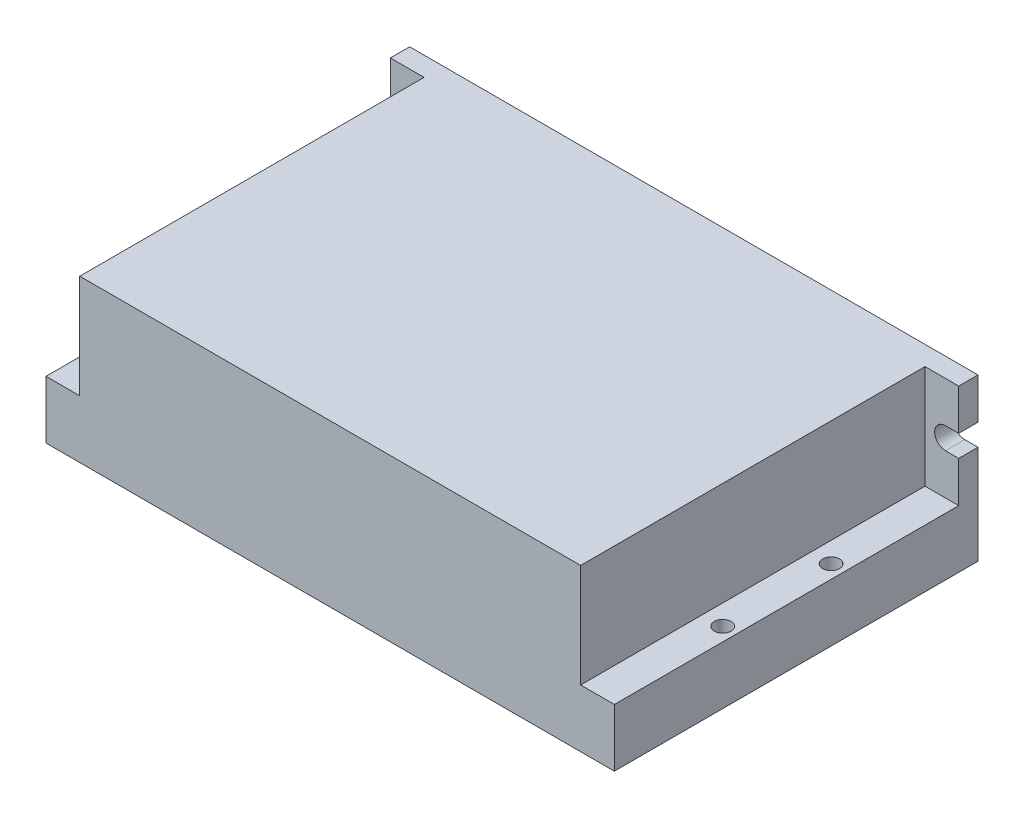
from build123d import *

# Parameters (mm, degrees)
SKETCH_1_W          = 118
SKETCH_1_H          = 75.5
EXTRUDE_1_DEPTH     = 33.5
SKETCH_2_W          = 7
SKETCH_2_H          = 21.5
CUT_EXTRUDE_1_DEPTH = 71.5
CUT_EXTRUDE_2_DEPTH = 4
SKETCH_5_R          = 1.75
CUT_EXTRUDE_3_DEPTH = 12


with BuildPart() as part:
    # Sketch 1 → Extrude 1 (new body)
    with BuildSketch(Plane(origin=(0, 0, 0), x_dir=(1, 0, 0), z_dir=(0, 1, 0))):
        with Locations((59, 37.75)):
            Rectangle(SKETCH_1_W, SKETCH_1_H)
    extrude(amount=EXTRUDE_1_DEPTH)

    # Sketch 2 → Cut-Extrude 1 (cut)
    with BuildSketch(Plane.XY):
        with Locations((3.5, 22.75)):
            Rectangle(SKETCH_2_W, SKETCH_2_H)
        with Locations((114.5, 22.75)):
            Rectangle(SKETCH_2_W, SKETCH_2_H)
    extrude(amount=-CUT_EXTRUDE_1_DEPTH, mode=Mode.SUBTRACT)

    # Sketch 3 → Cut-Extrude 2 (cut)
    with BuildSketch(Plane.XY.offset(-71.5)):
        with BuildLine():
            Line((115.25, 25), (118, 25))
            Line((118, 25), (118, 20.5))
            Line((118, 20.5), (115.25, 20.5))
            ThreePointArc((115.25, 20.5), (113, 22.75), (115.25, 25))
        make_face()
        with BuildLine():
            Line((2.75, 25), (0, 25))
            Line((0, 25), (0, 20.5))
            Line((0, 20.5), (2.75, 20.5))
            ThreePointArc((2.75, 20.5), (5, 22.75), (2.75, 25))
        make_face()
    extrude(amount=-CUT_EXTRUDE_2_DEPTH, mode=Mode.SUBTRACT)

    # Sketch 5 → Cut-Extrude 3 (cut)
    with BuildSketch(Plane(origin=(0, 12, 0), x_dir=(1, 0, 0), z_dir=(0, 1, 0))):
        with Locations(Location((115.2, 47.8, 0), (0, 0, 270))):
            Circle(SKETCH_5_R)
        with Locations(Location((115.2, 25.3, 0), (0, 0, 270))):
            Circle(SKETCH_5_R)
        with Locations(Location((2.8, 25.3, 0), (0, 0, 270))):
            Circle(SKETCH_5_R)
        with Locations(Location((2.8, 47.8, 0), (0, 0, 270))):
            Circle(SKETCH_5_R)
    extrude(amount=-CUT_EXTRUDE_3_DEPTH, mode=Mode.SUBTRACT)


solid = part.part
